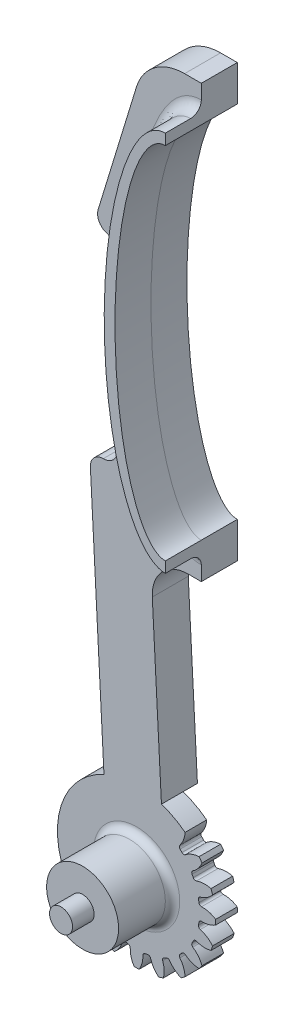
from build123d import *

# Parameters (mm, degrees)
BOSS_EXTRU_1_DEPTH                 = 5
CONG_1_R                           = 0.35
R_P_TITION_CIRCULAIRE4_COUNT       = 20
CONG_1_OF_R_P_TITION_CIRCULAIRE4_R = 0.35
BOSS_EXTRU_2_START                 = -5
BOSS_EXTRU_2_DEPTH                 = 5
ESQUISSE7_R                        = 11
ENL_V_MAT_EXTRU_1_DEPTH            = 2
ESQUISSE8_R                        = 5
BOSS_EXTRU_3_DEPTH                 = 7.5
ESQUISSE9_R                        = 1.6
BOSS_EXTRU_4_DEPTH                 = 3
BOSS_EXTRU_5_START                 = 2
ESQUISSE10_R                       = 1.6
BOSS_EXTRU_5_DEPTH                 = 2
BOSS_EXTRU_6_DEPTH                 = 5
CONG_2_R                           = 1.5
CONG_3_R                           = 1


with BuildPart() as part:
    # Esquisse3 → Boss.-Extru.1 (new body)
    with BuildSketch(Plane.XY):
        with BuildLine():
            Line((-2.747508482, 8.081920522), (-1.378706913, -0.560352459))
            Line((-1.378706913, -0.560352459), (-0.009905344, 8.081920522))
            ThreePointArc((-0.009905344, 8.081920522), (-0.267047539, 8.11874389), (-0.52516949, 8.147917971))
            ThreePointArc((-0.52516949, 8.147917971), (-0.577056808, 9.335581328), (-1.031324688, 10.434160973))
            ThreePointArc((-1.031324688, 10.434160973), (-1.378706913, 10.439647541), (-1.726089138, 10.434160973))
            ThreePointArc((-1.726089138, 10.434160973), (-2.180357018, 9.335581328), (-2.232244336, 8.147917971))
            ThreePointArc((-2.232244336, 8.147917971), (-2.490366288, 8.11874389), (-2.747508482, 8.081920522))
        make_face()
    boss_extru_1 = extrude(amount=BOSS_EXTRU_1_DEPTH)

    # Cong_1
    cong_1_edges = [part.edges().sort_by_distance(p)[0] for p in [
        (-2.232244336, 8.147917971, 2.5),
        (-0.52516949, 8.147917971, 2.5),
    ]]
    fillet(cong_1_edges, radius=CONG_1_R)

    # R_p_tition circulaire4: Boss.-Extru.1 ×20 about axis
    r_p_tition_circulaire4_axis = Axis((-1.378706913, -0.560352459, 0), (0, 0, 1))
    for i in range(1, R_P_TITION_CIRCULAIRE4_COUNT):
        add(boss_extru_1.rotate(r_p_tition_circulaire4_axis, i * 360 / R_P_TITION_CIRCULAIRE4_COUNT))

    # Cong_1 of R_p_tition circulaire4
    cong_1_of_r_p_tition_circulaire4_edges = [part.edges().sort_by_distance(p)[0] for p in [
        (-4.881472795, 7.45794731, 2.5),
        (-3.257948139, 7.985462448, 2.5),
        (-7.187826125, 5.983089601, 2.5),
        (-5.806773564, 6.98648302, 2.5),
        (-8.925542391, 3.867714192, 2.5),
        (-7.922148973, 5.248766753, 2.5),
        (-9.924521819, 1.318888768, 2.5),
        (-9.397006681, 2.942413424, 2.5),
        (-10.086977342, -1.413889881, 2.5),
        (-10.086977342, 0.293184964, 2.5),
        (-9.397006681, -4.063118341, 2.5),
        (-9.924521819, -2.439593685, 2.5),
        (-7.922148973, -6.36947167, 2.5),
        (-8.925542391, -4.988419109, 2.5),
        (-5.806773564, -8.107187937, 2.5),
        (-7.187826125, -7.103794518, 2.5),
        (-3.257948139, -9.106167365, 2.5),
        (-4.881472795, -8.578652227, 2.5),
        (-0.52516949, -9.268622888, 2.5),
        (-2.232244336, -9.268622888, 2.5),
        (2.124058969, -8.578652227, 2.5),
        (0.500534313, -9.106167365, 2.5),
        (4.430412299, -7.103794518, 2.5),
        (3.049359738, -8.107187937, 2.5),
        (6.168128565, -4.988419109, 2.5),
        (5.164735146, -6.36947167, 2.5),
        (7.167107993, -2.439593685, 2.5),
        (6.639592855, -4.063118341, 2.5),
        (7.329563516, 0.293184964, 2.5),
        (7.329563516, -1.413889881, 2.5),
        (6.639592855, 2.942413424, 2.5),
        (7.167107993, 1.318888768, 2.5),
        (5.164735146, 5.248766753, 2.5),
        (6.168128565, 3.867714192, 2.5),
        (3.049359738, 6.98648302, 2.5),
        (4.430412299, 5.983089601, 2.5),
        (0.500534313, 7.985462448, 2.5),
        (2.124058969, 7.45794731, 2.5),
    ]]
    fillet(cong_1_of_r_p_tition_circulaire4_edges, radius=CONG_1_OF_R_P_TITION_CIRCULAIRE4_R)

    # Esquisse6 → Boss.-Extru.2 (add)
    with BuildSketch(Plane.XY.offset(5).offset(BOSS_EXTRU_2_START)):
        with BuildLine():
            Line((7.621293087, 39.439647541), (7.621293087, 44.439647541))
            add(Edge.make_bspline(
                [(7.621293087, 94.439647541), (0.621293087, 94.439647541), (0.621293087, 69.439647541), (0.621293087, 44.439647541), (7.621293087, 44.439647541)],
                knots=[3.141592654, 3.141592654, 3.141592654, 4.71238898, 4.71238898, 6.283185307, 6.283185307, 6.283185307], degree=2, weights=[1, 0.707106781, 1, 0.707106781, 1]))
            Line((7.621293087, 94.439647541), (7.621293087, 99.439647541))
            Line((7.621293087, 99.439647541), (5.298907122, 99.439647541))
            ThreePointArc((5.298907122, 99.439647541), (1.135147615, 98.066645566), (-1.39522617, 94.486249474))
            Line((-1.39522617, 94.486249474), (-6.722219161, 77.062440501))
            ThreePointArc((-6.722219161, 77.062440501), (-6.590176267, 75.69112262), (-5.527139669, 74.814822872))
            Line((-5.527139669, 74.814822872), (-5.498002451, 74.805914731))
            ThreePointArc((-5.498002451, 74.805914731), (-4.316850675, 73.832248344), (-4.170136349, 72.308561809))
            Line((-4.170136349, 72.308561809), (-4.273956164, 71.968982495))
            ThreePointArc((-4.273956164, 71.968982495), (-4.817577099, 69.411447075), (-4.908827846, 66.798367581))
            Line((-4.908827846, 66.798367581), (-4.0045815, 49.544319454))
            ThreePointArc((-4.0045815, 49.544319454), (-4.551091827, 48.06293839), (-6.001840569, 47.439647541))
            Line((-6.001840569, 47.439647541), (-6.002965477, 47.439647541))
            ThreePointArc((-6.002965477, 47.439647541), (-7.308639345, 46.878685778), (-7.80049864, 45.54544282))
            Line((-7.80049864, 45.54544282), (-5.909509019, 9.463211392))
            ThreePointArc((-5.909509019, 9.463211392), (-12.011890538, 2.25663281), (-10.277893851, -7.025990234))
            Line((-10.277893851, -7.025990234), (-1.378706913, -0.560352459))
            Line((-1.378706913, -0.560352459), (5.086930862, 8.33883448))
            ThreePointArc((5.086930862, 8.33883448), (3.642853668, 9.226573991), (2.079527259, 9.881899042))
            Line((2.079527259, 9.881899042), (0.805953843, 34.183127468))
            ThreePointArc((0.805953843, 34.183127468), (2.177125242, 37.891731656), (5.813314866, 39.444787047))
            Line((5.813314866, 39.444787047), (7.621293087, 39.439647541))
        make_face()
    extrude(amount=BOSS_EXTRU_2_DEPTH)

    # Esquisse7 → Enl_v. mat.-Extru.1 (cut)
    with BuildSketch(Plane.XY):
        with Locations((-1.378706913, -0.560352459)):
            Circle(ESQUISSE7_R)
    extrude(amount=ENL_V_MAT_EXTRU_1_DEPTH, mode=Mode.SUBTRACT)

    # Esquisse8 → Boss.-Extru.3 (add)
    with BuildSketch(Plane.XY.offset(5)):
        with Locations((-1.378706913, -0.560352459)):
            Circle(ESQUISSE8_R)
    extrude(amount=BOSS_EXTRU_3_DEPTH)

    # Esquisse9 → Boss.-Extru.4 (add)
    with BuildSketch(Plane.XY.offset(12.5)):
        with Locations((-1.378706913, -0.560352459)):
            Circle(ESQUISSE9_R)
    extrude(amount=BOSS_EXTRU_4_DEPTH)

    # Esquisse10 → Boss.-Extru.5 (add)
    with BuildSketch(Plane(origin=(0, 0, 2), x_dir=(-1, 0, 0), z_dir=(0, 0, -1)).offset(BOSS_EXTRU_5_START)):
        with Locations(Location((1.378706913, -0.560352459, 0), (0, 0, 180))):
            Circle(ESQUISSE10_R)
    extrude(amount=-BOSS_EXTRU_5_DEPTH)

    # Esquisse11 → Boss.-Extru.6 (add)
    with BuildSketch(Plane.XY.offset(5)):
        with BuildLine():
            Line((7.621293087, 94.439647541), (7.621293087, 95.939647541))
            add(Edge.make_bspline(
                [(7.621293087, 95.939647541), (-0.878706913, 95.939647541), (-0.878706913, 69.439647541), (-0.878706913, 42.939647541), (7.621293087, 42.939647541)],
                knots=[3.141592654, 3.141592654, 3.141592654, 4.71238898, 4.71238898, 6.283185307, 6.283185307, 6.283185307], degree=2, weights=[1, 0.707106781, 1, 0.707106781, 1]))
            Line((7.621293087, 42.939647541), (7.621293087, 44.439647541))
            add(Edge.make_bspline(
                [(7.621293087, 94.439647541), (0.621293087, 94.439647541), (0.621293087, 69.439647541), (0.621293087, 44.439647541), (7.621293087, 44.439647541)],
                knots=[0, 0, 0, 1.570796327, 1.570796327, 3.141592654, 3.141592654, 3.141592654], degree=2, weights=[1, 0.707106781, 1, 0.707106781, 1]))
        make_face()
    extrude(amount=BOSS_EXTRU_6_DEPTH)

    # Cong_2
    cong_2_edges = [part.edges().sort_by_distance(p)[0] for p in [
        (-0.878706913, 69.439647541, 5),
    ]]
    fillet(cong_2_edges, radius=CONG_2_R)

    # Cong_3
    cong_3_edges = [part.edges().sort_by_distance(p)[0] for p in [
        (-6.378706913, -0.560352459, 5),
    ]]
    fillet(cong_3_edges, radius=CONG_3_R)


solid = part.part
